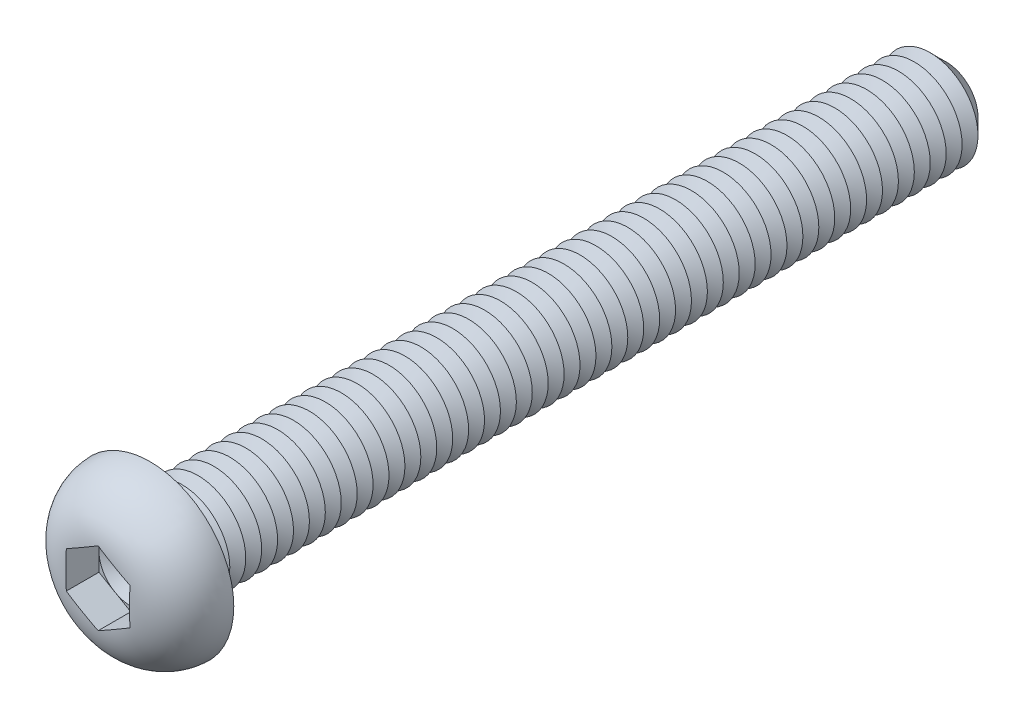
from build123d import *

# Parameters (mm, degrees)
CUT_EXTRUDE1_DEPTH  = 2.08
SKETCH4_R           = 3
BOSS_EXTRUDE1_DEPTH = 50
CHAMFER1_SIZE       = 1
LPATTERN1_COUNT     = 48
LPATTERN1_PITCH     = 1
FILLET2_R           = 0.5


with BuildPart() as part:
    # Sketch2 → Revolve1 (revolve)
    with BuildSketch(Plane(origin=(0, 0, 0), x_dir=(0, 0, -1), z_dir=(1, 0, 0)), mode=Mode.PRIVATE) as revolve1_sk:
        with BuildLine():
            Line((0, 0), (-3.3, 0))
            Line((-3.3, 0), (-3.3, 1.851470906))
            ThreePointArc((-3.3, 1.851470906), (-2.339262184, 4.220014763), (0, 5.25))
            Line((0, 5.25), (0, 0))
        make_face()
    revolve(revolve1_sk.sketch.rotate(Axis((0, 0, 47.934239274), (0, 0, -1)), 90), axis=Axis((0, 0, 47.934239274), (0, 0, -1)))

    # Sketch3 → Cut-Extrude1 (cut)
    with BuildSketch(Plane.XY.offset(3.3)):
        Polygon((0, 2.309401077), (-2, 1.154700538), (-2, -1.154700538), (0, -2.309401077), (2, -1.154700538), (2, 1.154700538), align=None)
    extrude(amount=-CUT_EXTRUDE1_DEPTH, mode=Mode.SUBTRACT)

    # Sketch4 → Boss-Extrude1 (add)
    with BuildSketch(Plane(origin=(0, 0, 0), x_dir=(-1, 0, 0), z_dir=(0, 0, -1))):
        Circle(SKETCH4_R)
    extrude(amount=BOSS_EXTRUDE1_DEPTH)

    # Chamfer1
    chamfer1_edges = [part.edges().sort_by_distance(p)[0] for p in [
        (3, 0, -50),
    ]]
    chamfer(chamfer1_edges, length=CHAMFER1_SIZE)

    # Sketch5 → Cut-Revolve1 (revolve, cut)
    with BuildSketch(Plane(origin=(0, 0, 0), x_dir=(0, 0, -1), z_dir=(1, 0, 0)), mode=Mode.PRIVATE) as cut_revolve1_sk:
        Polygon((1, 3), (2, 3), (1.5, 2.133974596), align=None)
    cut_revolve1 = revolve(cut_revolve1_sk.sketch.rotate(Axis((0, 0, 47.934239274), (0, 0, -1)), 90), axis=Axis((0, 0, 47.934239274), (0, 0, -1)), mode=Mode.SUBTRACT)

    # LPattern1: Cut-Revolve1 ×48
    with Locations(*[(0, 0, -i * LPATTERN1_PITCH) for i in range(1, LPATTERN1_COUNT)]):
        add(cut_revolve1, mode=Mode.SUBTRACT)

    # Fillet2
    fillet2_edges = [part.edges().sort_by_distance(p)[0] for p in [
        (3, 0, 0),
    ]]
    fillet(fillet2_edges, radius=FILLET2_R)

    # Cut-Extrude2 cone 1 section (on through the dimple's axis) → Cut-Extrude2 (revolve, cut)
    with BuildSketch(Plane(origin=(0, 0, 1.22), x_dir=(0, -1, 0), z_dir=(1, 0, 0))):
        Polygon((0, 0), (2, 0), (0, 1.154700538), align=None)
    revolve(axis=Axis((0, 0, 1.22), (0, 0, -1)), mode=Mode.SUBTRACT)


solid = part.part
